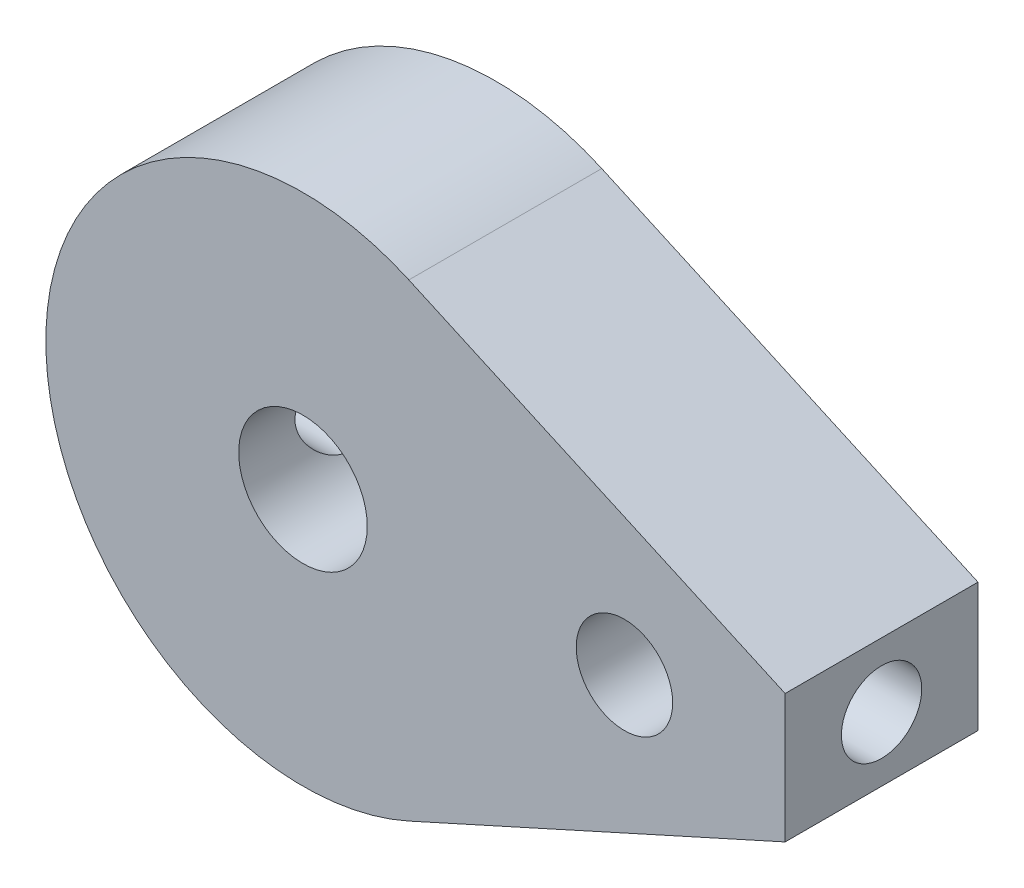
from build123d import *

# Parameters (mm, degrees)
ESQUISSE1_R            = 1.5
ESQUISSE1_R_2          = 2
BOSS_EXTRU_1_DEPTH     = 6
TROU_TARAUD_M31_REACH  = 27.08
TROU_TARAUD_M31_BORE_R = 1.25
TROU_TARAUD_M32_REACH  = 27.08
TROU_TARAUD_M32_BORE_R = 1.25


with BuildPart() as part:
    # Esquisse1 → Boss.-Extru.1 (new body)
    with BuildSketch(Plane.XY):
        with BuildLine():
            Line((0, -2), (0, 2))
            Line((0, 2), (-11.705343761, 7.290078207))
            ThreePointArc((-11.705343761, 7.290078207), (-23, 0), (-11.705343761, -7.290078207))
            Line((-11.705343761, -7.290078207), (0, -2))
        make_face()
        with Locations((-5, 0)):
            Circle(ESQUISSE1_R, mode=Mode.SUBTRACT)
        with Locations((-15, 0)):
            Circle(ESQUISSE1_R_2, mode=Mode.SUBTRACT)
    extrude(amount=BOSS_EXTRU_1_DEPTH)

    # Trou taraud_ M31 bore → Trou taraud_ M31 (cut, up to next)
    with BuildSketch(Plane(origin=(0, 0, 0), x_dir=(0, 0, -1), z_dir=(1, 0, 0)), mode=Mode.PRIVATE) as trou_taraud_m31_sk1:
        with Locations((-3, 0)):
            Circle(TROU_TARAUD_M31_BORE_R)
    trou_taraud_m31_tool1 = extrude(trou_taraud_m31_sk1.sketch, amount=-TROU_TARAUD_M31_REACH, mode=Mode.PRIVATE) & part.part
    add(trou_taraud_m31_tool1.solids().sort_by_distance((0, 0, 3))[0], mode=Mode.SUBTRACT)

    # Trou taraud_ M32 bore → Trou taraud_ M32 (cut, up to next)
    with BuildSketch(Plane(origin=(-23, 0, 0), x_dir=(0, 0, -1), z_dir=(-1, 0, 0)), mode=Mode.PRIVATE) as trou_taraud_m32_sk1:
        with Locations((-3, 0)):
            Circle(TROU_TARAUD_M32_BORE_R)
    trou_taraud_m32_tool1 = extrude(trou_taraud_m32_sk1.sketch, amount=-TROU_TARAUD_M32_REACH, mode=Mode.PRIVATE) & part.part
    add(trou_taraud_m32_tool1.solids().sort_by_distance((-23, 0, 3))[0], mode=Mode.SUBTRACT)


solid = part.part
